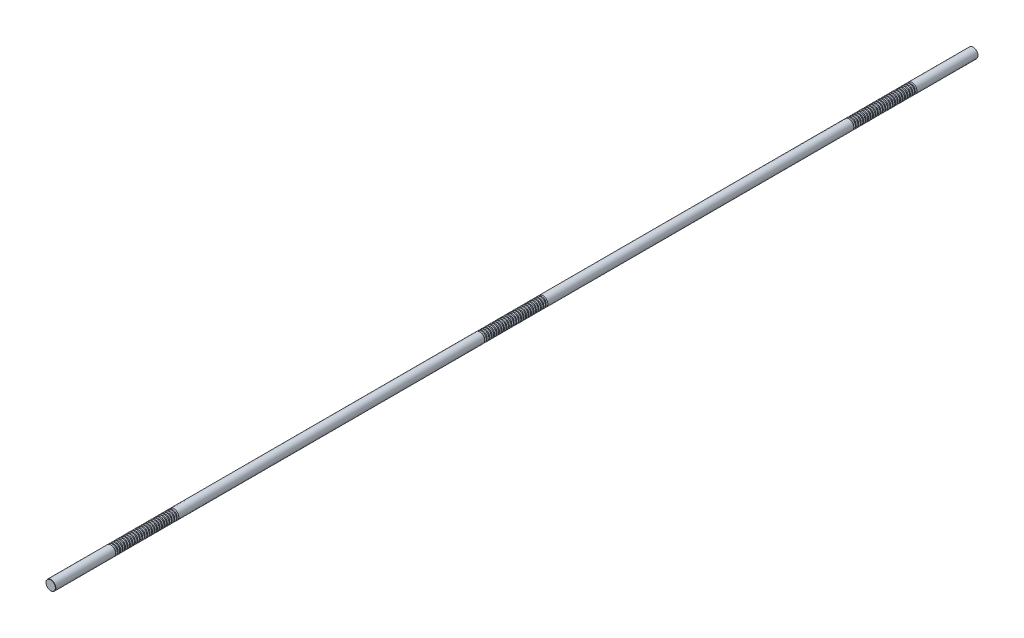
from build123d import *

# Parameters (mm, degrees)
SKETCH1_R           = 8
BOSS_EXTRUDE1_DEPTH = 750
CHAMFER1_SIZE       = 0.4
LPATTERN1_COUNT     = 26
LPATTERN1_PITCH     = 4
LPATTERN2_COUNT     = 3
LPATTERN2_PITCH     = 600


with BuildPart() as part:
    # Sketch1 → Boss-Extrude1 (new, symmetric)
    with BuildSketch(Plane.XY):
        Circle(SKETCH1_R)
    extrude(amount=BOSS_EXTRUDE1_DEPTH, both=True)

    # Chamfer1
    chamfer1_edges = [part.edges().sort_by_distance(p)[0] for p in [
        (-8, 0, -750),
        (-8, 0, 750),
    ]]
    chamfer(chamfer1_edges, length=CHAMFER1_SIZE)

    # Sketch2 → Cut-Revolve1 (revolve, cut)
    with BuildSketch(Plane(origin=(0, 0, 0), x_dir=(0, 0, -1), z_dir=(1, 0, 0)), mode=Mode.PRIVATE) as cut_revolve1_sk:
        Polygon((650.301442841, 8), (647.698557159, 8), (648.301442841, 5.75), (649.698557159, 5.75), align=None)
    cut_revolve1 = revolve(cut_revolve1_sk.sketch.rotate(Axis((0, 0, 750), (0, 0, -1)), 90), axis=Axis((0, 0, 750), (0, 0, -1)), mode=Mode.SUBTRACT)

    # LPattern1: Cut-Revolve1 ×26
    with Locations(*[(0, 0, i * LPATTERN1_PITCH) for i in range(1, LPATTERN1_COUNT)]):
        add(cut_revolve1, mode=Mode.SUBTRACT)

    # LPattern2: Cut-Revolve1 ×3
    with Locations(*[(0, 0, i * LPATTERN2_PITCH) for i in range(1, LPATTERN2_COUNT)]):
        add(cut_revolve1, mode=Mode.SUBTRACT)

    # LPattern2 copy 1 sketch → LPattern2 copy 1 (revolve, cut)
    with BuildSketch(Plane(origin=(0, 0, 604), x_dir=(0, 0, -1), z_dir=(1, 0, 0))):
        Polygon((650.301442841, 8), (647.698557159, 8), (648.301442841, 5.75), (649.698557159, 5.75), align=None)
    revolve(axis=Axis((0, 0, 1354), (0, 0, -1)), mode=Mode.SUBTRACT)

    # LPattern2 copy 2 sketch → LPattern2 copy 2 (revolve, cut)
    with BuildSketch(Plane(origin=(0, 0, 1204), x_dir=(0, 0, -1), z_dir=(1, 0, 0))):
        Polygon((650.301442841, 8), (647.698557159, 8), (648.301442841, 5.75), (649.698557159, 5.75), align=None)
    revolve(axis=Axis((0, 0, 1954), (0, 0, -1)), mode=Mode.SUBTRACT)

    # LPattern2 copy 3 sketch → LPattern2 copy 3 (revolve, cut)
    with BuildSketch(Plane(origin=(0, 0, 608), x_dir=(0, 0, -1), z_dir=(1, 0, 0))):
        Polygon((650.301442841, 8), (647.698557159, 8), (648.301442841, 5.75), (649.698557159, 5.75), align=None)
    revolve(axis=Axis((0, 0, 1358), (0, 0, -1)), mode=Mode.SUBTRACT)

    # LPattern2 copy 4 sketch → LPattern2 copy 4 (revolve, cut)
    with BuildSketch(Plane(origin=(0, 0, 1208), x_dir=(0, 0, -1), z_dir=(1, 0, 0))):
        Polygon((650.301442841, 8), (647.698557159, 8), (648.301442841, 5.75), (649.698557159, 5.75), align=None)
    revolve(axis=Axis((0, 0, 1958), (0, 0, -1)), mode=Mode.SUBTRACT)

    # LPattern2 copy 5 sketch → LPattern2 copy 5 (revolve, cut)
    with BuildSketch(Plane(origin=(0, 0, 612), x_dir=(0, 0, -1), z_dir=(1, 0, 0))):
        Polygon((650.301442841, 8), (647.698557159, 8), (648.301442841, 5.75), (649.698557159, 5.75), align=None)
    revolve(axis=Axis((0, 0, 1362), (0, 0, -1)), mode=Mode.SUBTRACT)

    # LPattern2 copy 6 sketch → LPattern2 copy 6 (revolve, cut)
    with BuildSketch(Plane(origin=(0, 0, 1212), x_dir=(0, 0, -1), z_dir=(1, 0, 0))):
        Polygon((650.301442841, 8), (647.698557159, 8), (648.301442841, 5.75), (649.698557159, 5.75), align=None)
    revolve(axis=Axis((0, 0, 1962), (0, 0, -1)), mode=Mode.SUBTRACT)

    # LPattern2 copy 7 sketch → LPattern2 copy 7 (revolve, cut)
    with BuildSketch(Plane(origin=(0, 0, 616), x_dir=(0, 0, -1), z_dir=(1, 0, 0))):
        Polygon((650.301442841, 8), (647.698557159, 8), (648.301442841, 5.75), (649.698557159, 5.75), align=None)
    revolve(axis=Axis((0, 0, 1366), (0, 0, -1)), mode=Mode.SUBTRACT)

    # LPattern2 copy 8 sketch → LPattern2 copy 8 (revolve, cut)
    with BuildSketch(Plane(origin=(0, 0, 1216), x_dir=(0, 0, -1), z_dir=(1, 0, 0))):
        Polygon((650.301442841, 8), (647.698557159, 8), (648.301442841, 5.75), (649.698557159, 5.75), align=None)
    revolve(axis=Axis((0, 0, 1966), (0, 0, -1)), mode=Mode.SUBTRACT)

    # LPattern2 copy 9 sketch → LPattern2 copy 9 (revolve, cut)
    with BuildSketch(Plane(origin=(0, 0, 620), x_dir=(0, 0, -1), z_dir=(1, 0, 0))):
        Polygon((650.301442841, 8), (647.698557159, 8), (648.301442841, 5.75), (649.698557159, 5.75), align=None)
    revolve(axis=Axis((0, 0, 1370), (0, 0, -1)), mode=Mode.SUBTRACT)

    # LPattern2 copy 10 sketch → LPattern2 copy 10 (revolve, cut)
    with BuildSketch(Plane(origin=(0, 0, 1220), x_dir=(0, 0, -1), z_dir=(1, 0, 0))):
        Polygon((650.301442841, 8), (647.698557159, 8), (648.301442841, 5.75), (649.698557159, 5.75), align=None)
    revolve(axis=Axis((0, 0, 1970), (0, 0, -1)), mode=Mode.SUBTRACT)

    # LPattern2 copy 11 sketch → LPattern2 copy 11 (revolve, cut)
    with BuildSketch(Plane(origin=(0, 0, 624), x_dir=(0, 0, -1), z_dir=(1, 0, 0))):
        Polygon((650.301442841, 8), (647.698557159, 8), (648.301442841, 5.75), (649.698557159, 5.75), align=None)
    revolve(axis=Axis((0, 0, 1374), (0, 0, -1)), mode=Mode.SUBTRACT)

    # LPattern2 copy 12 sketch → LPattern2 copy 12 (revolve, cut)
    with BuildSketch(Plane(origin=(0, 0, 1224), x_dir=(0, 0, -1), z_dir=(1, 0, 0))):
        Polygon((650.301442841, 8), (647.698557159, 8), (648.301442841, 5.75), (649.698557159, 5.75), align=None)
    revolve(axis=Axis((0, 0, 1974), (0, 0, -1)), mode=Mode.SUBTRACT)

    # LPattern2 copy 13 sketch → LPattern2 copy 13 (revolve, cut)
    with BuildSketch(Plane(origin=(0, 0, 628), x_dir=(0, 0, -1), z_dir=(1, 0, 0))):
        Polygon((650.301442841, 8), (647.698557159, 8), (648.301442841, 5.75), (649.698557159, 5.75), align=None)
    revolve(axis=Axis((0, 0, 1378), (0, 0, -1)), mode=Mode.SUBTRACT)

    # LPattern2 copy 14 sketch → LPattern2 copy 14 (revolve, cut)
    with BuildSketch(Plane(origin=(0, 0, 1228), x_dir=(0, 0, -1), z_dir=(1, 0, 0))):
        Polygon((650.301442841, 8), (647.698557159, 8), (648.301442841, 5.75), (649.698557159, 5.75), align=None)
    revolve(axis=Axis((0, 0, 1978), (0, 0, -1)), mode=Mode.SUBTRACT)

    # LPattern2 copy 15 sketch → LPattern2 copy 15 (revolve, cut)
    with BuildSketch(Plane(origin=(0, 0, 632), x_dir=(0, 0, -1), z_dir=(1, 0, 0))):
        Polygon((650.301442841, 8), (647.698557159, 8), (648.301442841, 5.75), (649.698557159, 5.75), align=None)
    revolve(axis=Axis((0, 0, 1382), (0, 0, -1)), mode=Mode.SUBTRACT)

    # LPattern2 copy 16 sketch → LPattern2 copy 16 (revolve, cut)
    with BuildSketch(Plane(origin=(0, 0, 1232), x_dir=(0, 0, -1), z_dir=(1, 0, 0))):
        Polygon((650.301442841, 8), (647.698557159, 8), (648.301442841, 5.75), (649.698557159, 5.75), align=None)
    revolve(axis=Axis((0, 0, 1982), (0, 0, -1)), mode=Mode.SUBTRACT)

    # LPattern2 copy 17 sketch → LPattern2 copy 17 (revolve, cut)
    with BuildSketch(Plane(origin=(0, 0, 636), x_dir=(0, 0, -1), z_dir=(1, 0, 0))):
        Polygon((650.301442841, 8), (647.698557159, 8), (648.301442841, 5.75), (649.698557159, 5.75), align=None)
    revolve(axis=Axis((0, 0, 1386), (0, 0, -1)), mode=Mode.SUBTRACT)

    # LPattern2 copy 18 sketch → LPattern2 copy 18 (revolve, cut)
    with BuildSketch(Plane(origin=(0, 0, 1236), x_dir=(0, 0, -1), z_dir=(1, 0, 0))):
        Polygon((650.301442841, 8), (647.698557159, 8), (648.301442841, 5.75), (649.698557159, 5.75), align=None)
    revolve(axis=Axis((0, 0, 1986), (0, 0, -1)), mode=Mode.SUBTRACT)

    # LPattern2 copy 19 sketch → LPattern2 copy 19 (revolve, cut)
    with BuildSketch(Plane(origin=(0, 0, 640), x_dir=(0, 0, -1), z_dir=(1, 0, 0))):
        Polygon((650.301442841, 8), (647.698557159, 8), (648.301442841, 5.75), (649.698557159, 5.75), align=None)
    revolve(axis=Axis((0, 0, 1390), (0, 0, -1)), mode=Mode.SUBTRACT)

    # LPattern2 copy 20 sketch → LPattern2 copy 20 (revolve, cut)
    with BuildSketch(Plane(origin=(0, 0, 1240), x_dir=(0, 0, -1), z_dir=(1, 0, 0))):
        Polygon((650.301442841, 8), (647.698557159, 8), (648.301442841, 5.75), (649.698557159, 5.75), align=None)
    revolve(axis=Axis((0, 0, 1990), (0, 0, -1)), mode=Mode.SUBTRACT)

    # LPattern2 copy 21 sketch → LPattern2 copy 21 (revolve, cut)
    with BuildSketch(Plane(origin=(0, 0, 644), x_dir=(0, 0, -1), z_dir=(1, 0, 0))):
        Polygon((650.301442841, 8), (647.698557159, 8), (648.301442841, 5.75), (649.698557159, 5.75), align=None)
    revolve(axis=Axis((0, 0, 1394), (0, 0, -1)), mode=Mode.SUBTRACT)

    # LPattern2 copy 22 sketch → LPattern2 copy 22 (revolve, cut)
    with BuildSketch(Plane(origin=(0, 0, 1244), x_dir=(0, 0, -1), z_dir=(1, 0, 0))):
        Polygon((650.301442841, 8), (647.698557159, 8), (648.301442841, 5.75), (649.698557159, 5.75), align=None)
    revolve(axis=Axis((0, 0, 1994), (0, 0, -1)), mode=Mode.SUBTRACT)

    # LPattern2 copy 23 sketch → LPattern2 copy 23 (revolve, cut)
    with BuildSketch(Plane(origin=(0, 0, 648), x_dir=(0, 0, -1), z_dir=(1, 0, 0))):
        Polygon((650.301442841, 8), (647.698557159, 8), (648.301442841, 5.75), (649.698557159, 5.75), align=None)
    revolve(axis=Axis((0, 0, 1398), (0, 0, -1)), mode=Mode.SUBTRACT)

    # LPattern2 copy 24 sketch → LPattern2 copy 24 (revolve, cut)
    with BuildSketch(Plane(origin=(0, 0, 1248), x_dir=(0, 0, -1), z_dir=(1, 0, 0))):
        Polygon((650.301442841, 8), (647.698557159, 8), (648.301442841, 5.75), (649.698557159, 5.75), align=None)
    revolve(axis=Axis((0, 0, 1998), (0, 0, -1)), mode=Mode.SUBTRACT)

    # LPattern2 copy 25 sketch → LPattern2 copy 25 (revolve, cut)
    with BuildSketch(Plane(origin=(0, 0, 652), x_dir=(0, 0, -1), z_dir=(1, 0, 0))):
        Polygon((650.301442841, 8), (647.698557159, 8), (648.301442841, 5.75), (649.698557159, 5.75), align=None)
    revolve(axis=Axis((0, 0, 1402), (0, 0, -1)), mode=Mode.SUBTRACT)

    # LPattern2 copy 26 sketch → LPattern2 copy 26 (revolve, cut)
    with BuildSketch(Plane(origin=(0, 0, 1252), x_dir=(0, 0, -1), z_dir=(1, 0, 0))):
        Polygon((650.301442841, 8), (647.698557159, 8), (648.301442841, 5.75), (649.698557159, 5.75), align=None)
    revolve(axis=Axis((0, 0, 2002), (0, 0, -1)), mode=Mode.SUBTRACT)

    # LPattern2 copy 27 sketch → LPattern2 copy 27 (revolve, cut)
    with BuildSketch(Plane(origin=(0, 0, 656), x_dir=(0, 0, -1), z_dir=(1, 0, 0))):
        Polygon((650.301442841, 8), (647.698557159, 8), (648.301442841, 5.75), (649.698557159, 5.75), align=None)
    revolve(axis=Axis((0, 0, 1406), (0, 0, -1)), mode=Mode.SUBTRACT)

    # LPattern2 copy 28 sketch → LPattern2 copy 28 (revolve, cut)
    with BuildSketch(Plane(origin=(0, 0, 1256), x_dir=(0, 0, -1), z_dir=(1, 0, 0))):
        Polygon((650.301442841, 8), (647.698557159, 8), (648.301442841, 5.75), (649.698557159, 5.75), align=None)
    revolve(axis=Axis((0, 0, 2006), (0, 0, -1)), mode=Mode.SUBTRACT)

    # LPattern2 copy 29 sketch → LPattern2 copy 29 (revolve, cut)
    with BuildSketch(Plane(origin=(0, 0, 660), x_dir=(0, 0, -1), z_dir=(1, 0, 0))):
        Polygon((650.301442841, 8), (647.698557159, 8), (648.301442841, 5.75), (649.698557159, 5.75), align=None)
    revolve(axis=Axis((0, 0, 1410), (0, 0, -1)), mode=Mode.SUBTRACT)

    # LPattern2 copy 30 sketch → LPattern2 copy 30 (revolve, cut)
    with BuildSketch(Plane(origin=(0, 0, 1260), x_dir=(0, 0, -1), z_dir=(1, 0, 0))):
        Polygon((650.301442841, 8), (647.698557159, 8), (648.301442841, 5.75), (649.698557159, 5.75), align=None)
    revolve(axis=Axis((0, 0, 2010), (0, 0, -1)), mode=Mode.SUBTRACT)

    # LPattern2 copy 31 sketch → LPattern2 copy 31 (revolve, cut)
    with BuildSketch(Plane(origin=(0, 0, 664), x_dir=(0, 0, -1), z_dir=(1, 0, 0))):
        Polygon((650.301442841, 8), (647.698557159, 8), (648.301442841, 5.75), (649.698557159, 5.75), align=None)
    revolve(axis=Axis((0, 0, 1414), (0, 0, -1)), mode=Mode.SUBTRACT)

    # LPattern2 copy 32 sketch → LPattern2 copy 32 (revolve, cut)
    with BuildSketch(Plane(origin=(0, 0, 1264), x_dir=(0, 0, -1), z_dir=(1, 0, 0))):
        Polygon((650.301442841, 8), (647.698557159, 8), (648.301442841, 5.75), (649.698557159, 5.75), align=None)
    revolve(axis=Axis((0, 0, 2014), (0, 0, -1)), mode=Mode.SUBTRACT)

    # LPattern2 copy 33 sketch → LPattern2 copy 33 (revolve, cut)
    with BuildSketch(Plane(origin=(0, 0, 668), x_dir=(0, 0, -1), z_dir=(1, 0, 0))):
        Polygon((650.301442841, 8), (647.698557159, 8), (648.301442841, 5.75), (649.698557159, 5.75), align=None)
    revolve(axis=Axis((0, 0, 1418), (0, 0, -1)), mode=Mode.SUBTRACT)

    # LPattern2 copy 34 sketch → LPattern2 copy 34 (revolve, cut)
    with BuildSketch(Plane(origin=(0, 0, 1268), x_dir=(0, 0, -1), z_dir=(1, 0, 0))):
        Polygon((650.301442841, 8), (647.698557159, 8), (648.301442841, 5.75), (649.698557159, 5.75), align=None)
    revolve(axis=Axis((0, 0, 2018), (0, 0, -1)), mode=Mode.SUBTRACT)

    # LPattern2 copy 35 sketch → LPattern2 copy 35 (revolve, cut)
    with BuildSketch(Plane(origin=(0, 0, 672), x_dir=(0, 0, -1), z_dir=(1, 0, 0))):
        Polygon((650.301442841, 8), (647.698557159, 8), (648.301442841, 5.75), (649.698557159, 5.75), align=None)
    revolve(axis=Axis((0, 0, 1422), (0, 0, -1)), mode=Mode.SUBTRACT)

    # LPattern2 copy 36 sketch → LPattern2 copy 36 (revolve, cut)
    with BuildSketch(Plane(origin=(0, 0, 1272), x_dir=(0, 0, -1), z_dir=(1, 0, 0))):
        Polygon((650.301442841, 8), (647.698557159, 8), (648.301442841, 5.75), (649.698557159, 5.75), align=None)
    revolve(axis=Axis((0, 0, 2022), (0, 0, -1)), mode=Mode.SUBTRACT)

    # LPattern2 copy 37 sketch → LPattern2 copy 37 (revolve, cut)
    with BuildSketch(Plane(origin=(0, 0, 676), x_dir=(0, 0, -1), z_dir=(1, 0, 0))):
        Polygon((650.301442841, 8), (647.698557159, 8), (648.301442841, 5.75), (649.698557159, 5.75), align=None)
    revolve(axis=Axis((0, 0, 1426), (0, 0, -1)), mode=Mode.SUBTRACT)

    # LPattern2 copy 38 sketch → LPattern2 copy 38 (revolve, cut)
    with BuildSketch(Plane(origin=(0, 0, 1276), x_dir=(0, 0, -1), z_dir=(1, 0, 0))):
        Polygon((650.301442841, 8), (647.698557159, 8), (648.301442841, 5.75), (649.698557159, 5.75), align=None)
    revolve(axis=Axis((0, 0, 2026), (0, 0, -1)), mode=Mode.SUBTRACT)

    # LPattern2 copy 39 sketch → LPattern2 copy 39 (revolve, cut)
    with BuildSketch(Plane(origin=(0, 0, 680), x_dir=(0, 0, -1), z_dir=(1, 0, 0))):
        Polygon((650.301442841, 8), (647.698557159, 8), (648.301442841, 5.75), (649.698557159, 5.75), align=None)
    revolve(axis=Axis((0, 0, 1430), (0, 0, -1)), mode=Mode.SUBTRACT)

    # LPattern2 copy 40 sketch → LPattern2 copy 40 (revolve, cut)
    with BuildSketch(Plane(origin=(0, 0, 1280), x_dir=(0, 0, -1), z_dir=(1, 0, 0))):
        Polygon((650.301442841, 8), (647.698557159, 8), (648.301442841, 5.75), (649.698557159, 5.75), align=None)
    revolve(axis=Axis((0, 0, 2030), (0, 0, -1)), mode=Mode.SUBTRACT)

    # LPattern2 copy 41 sketch → LPattern2 copy 41 (revolve, cut)
    with BuildSketch(Plane(origin=(0, 0, 684), x_dir=(0, 0, -1), z_dir=(1, 0, 0))):
        Polygon((650.301442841, 8), (647.698557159, 8), (648.301442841, 5.75), (649.698557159, 5.75), align=None)
    revolve(axis=Axis((0, 0, 1434), (0, 0, -1)), mode=Mode.SUBTRACT)

    # LPattern2 copy 42 sketch → LPattern2 copy 42 (revolve, cut)
    with BuildSketch(Plane(origin=(0, 0, 1284), x_dir=(0, 0, -1), z_dir=(1, 0, 0))):
        Polygon((650.301442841, 8), (647.698557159, 8), (648.301442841, 5.75), (649.698557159, 5.75), align=None)
    revolve(axis=Axis((0, 0, 2034), (0, 0, -1)), mode=Mode.SUBTRACT)

    # LPattern2 copy 43 sketch → LPattern2 copy 43 (revolve, cut)
    with BuildSketch(Plane(origin=(0, 0, 688), x_dir=(0, 0, -1), z_dir=(1, 0, 0))):
        Polygon((650.301442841, 8), (647.698557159, 8), (648.301442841, 5.75), (649.698557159, 5.75), align=None)
    revolve(axis=Axis((0, 0, 1438), (0, 0, -1)), mode=Mode.SUBTRACT)

    # LPattern2 copy 44 sketch → LPattern2 copy 44 (revolve, cut)
    with BuildSketch(Plane(origin=(0, 0, 1288), x_dir=(0, 0, -1), z_dir=(1, 0, 0))):
        Polygon((650.301442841, 8), (647.698557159, 8), (648.301442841, 5.75), (649.698557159, 5.75), align=None)
    revolve(axis=Axis((0, 0, 2038), (0, 0, -1)), mode=Mode.SUBTRACT)

    # LPattern2 copy 45 sketch → LPattern2 copy 45 (revolve, cut)
    with BuildSketch(Plane(origin=(0, 0, 692), x_dir=(0, 0, -1), z_dir=(1, 0, 0))):
        Polygon((650.301442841, 8), (647.698557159, 8), (648.301442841, 5.75), (649.698557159, 5.75), align=None)
    revolve(axis=Axis((0, 0, 1442), (0, 0, -1)), mode=Mode.SUBTRACT)

    # LPattern2 copy 46 sketch → LPattern2 copy 46 (revolve, cut)
    with BuildSketch(Plane(origin=(0, 0, 1292), x_dir=(0, 0, -1), z_dir=(1, 0, 0))):
        Polygon((650.301442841, 8), (647.698557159, 8), (648.301442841, 5.75), (649.698557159, 5.75), align=None)
    revolve(axis=Axis((0, 0, 2042), (0, 0, -1)), mode=Mode.SUBTRACT)

    # LPattern2 copy 47 sketch → LPattern2 copy 47 (revolve, cut)
    with BuildSketch(Plane(origin=(0, 0, 696), x_dir=(0, 0, -1), z_dir=(1, 0, 0))):
        Polygon((650.301442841, 8), (647.698557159, 8), (648.301442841, 5.75), (649.698557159, 5.75), align=None)
    revolve(axis=Axis((0, 0, 1446), (0, 0, -1)), mode=Mode.SUBTRACT)

    # LPattern2 copy 48 sketch → LPattern2 copy 48 (revolve, cut)
    with BuildSketch(Plane(origin=(0, 0, 1296), x_dir=(0, 0, -1), z_dir=(1, 0, 0))):
        Polygon((650.301442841, 8), (647.698557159, 8), (648.301442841, 5.75), (649.698557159, 5.75), align=None)
    revolve(axis=Axis((0, 0, 2046), (0, 0, -1)), mode=Mode.SUBTRACT)

    # LPattern2 copy 49 sketch → LPattern2 copy 49 (revolve, cut)
    with BuildSketch(Plane(origin=(0, 0, 700), x_dir=(0, 0, -1), z_dir=(1, 0, 0))):
        Polygon((650.301442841, 8), (647.698557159, 8), (648.301442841, 5.75), (649.698557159, 5.75), align=None)
    revolve(axis=Axis((0, 0, 1450), (0, 0, -1)), mode=Mode.SUBTRACT)

    # LPattern2 copy 50 sketch → LPattern2 copy 50 (revolve, cut)
    with BuildSketch(Plane(origin=(0, 0, 1300), x_dir=(0, 0, -1), z_dir=(1, 0, 0))):
        Polygon((650.301442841, 8), (647.698557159, 8), (648.301442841, 5.75), (649.698557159, 5.75), align=None)
    revolve(axis=Axis((0, 0, 2050), (0, 0, -1)), mode=Mode.SUBTRACT)


solid = part.part
